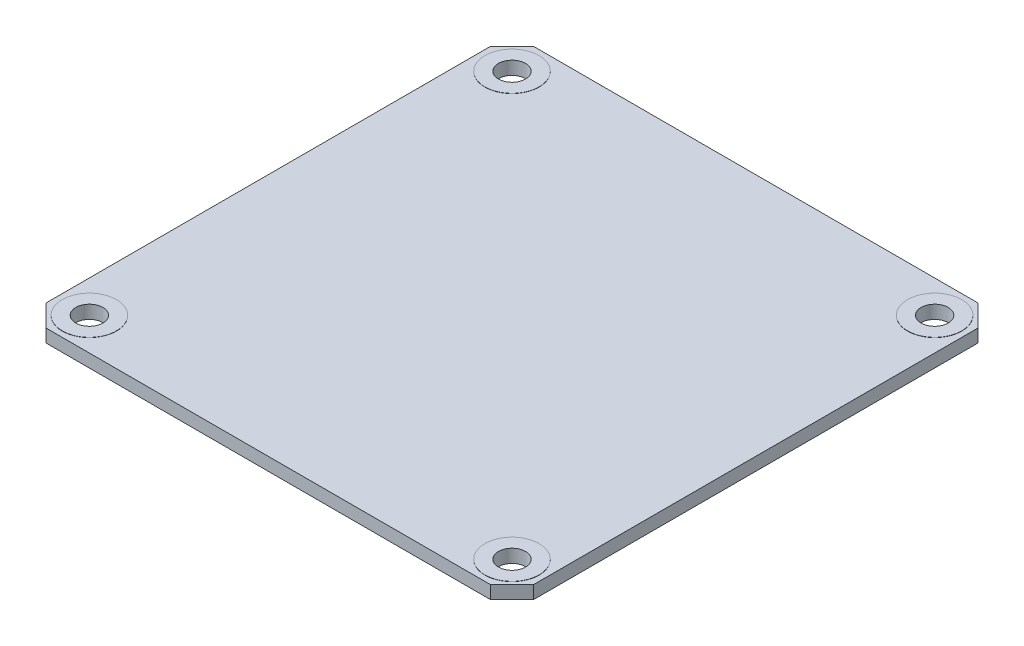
ISO-10303-21;
HEADER;
FILE_DESCRIPTION(('STEP AP214'),'2;1');
FILE_NAME('part.step','',(''),(''),'','','');
FILE_SCHEMA(('AUTOMOTIVE_DESIGN { 1 0 10303 214 1 1 1 1 }'));
ENDSEC;
DATA;
#1=APPLICATION_CONTEXT('core data for automotive mechanical design processes');
#2=APPLICATION_PROTOCOL_DEFINITION('international standard','automotive_design',2000,#1);
#3=PRODUCT_CONTEXT('',#1,'mechanical');
#4=PRODUCT('Part','Part','',(#3));
#5=PRODUCT_RELATED_PRODUCT_CATEGORY('part','',(#4));
#6=PRODUCT_DEFINITION_FORMATION('','',#4);
#7=PRODUCT_DEFINITION_CONTEXT('part definition',#1,'design');
#8=PRODUCT_DEFINITION('design','',#6,#7);
#9=PRODUCT_DEFINITION_SHAPE('','',#8);
#10=(LENGTH_UNIT() NAMED_UNIT(*) SI_UNIT(.MILLI.,.METRE.));
#11=(NAMED_UNIT(*) PLANE_ANGLE_UNIT() SI_UNIT($,.RADIAN.));
#12=(NAMED_UNIT(*) SI_UNIT($,.STERADIAN.) SOLID_ANGLE_UNIT());
#13=UNCERTAINTY_MEASURE_WITH_UNIT(LENGTH_MEASURE(1.E-05),#10,'distance_accuracy_value','');
#14=(GEOMETRIC_REPRESENTATION_CONTEXT(3) GLOBAL_UNCERTAINTY_ASSIGNED_CONTEXT((#13)) GLOBAL_UNIT_ASSIGNED_CONTEXT((#10,
#11,#12)) REPRESENTATION_CONTEXT('',''));
#15=CARTESIAN_POINT('',(0.,0.,0.));
#16=DIRECTION('',(0.,0.,1.));
#17=DIRECTION('',(1.,0.,0.));
#18=AXIS2_PLACEMENT_3D('',#15,#16,#17);
#19=CARTESIAN_POINT('',(3.81,1.524,-53.34));
#20=DIRECTION('',(0.,1.,0.));
#21=DIRECTION('',(0.,0.,1.));
#22=AXIS2_PLACEMENT_3D('',#19,#20,#21);
#23=CYLINDRICAL_SURFACE('',#22,3.175);
#24=CARTESIAN_POINT('',(3.81,1.5494,-53.34));
#25=DIRECTION('',(0.,1.,0.));
#26=DIRECTION('',(0.,0.,1.));
#27=AXIS2_PLACEMENT_3D('',#24,#25,#26);
#28=CIRCLE('',#27,3.175);
#29=CARTESIAN_POINT('',(3.81,1.5494,-50.165));
#30=VERTEX_POINT('',#29);
#31=EDGE_CURVE('E152',#30,#30,#28,.T.);
#32=ORIENTED_EDGE('',*,*,#31,.F.);
#33=EDGE_LOOP('',(#32));
#34=FACE_BOUND('',#33,.T.);
#35=CARTESIAN_POINT('',(3.81,1.524,-53.34));
#36=DIRECTION('',(0.,1.,0.));
#37=DIRECTION('',(0.,0.,1.));
#38=AXIS2_PLACEMENT_3D('',#35,#36,#37);
#39=CIRCLE('',#38,3.175);
#40=CARTESIAN_POINT('',(3.81,1.524,-50.165));
#41=VERTEX_POINT('',#40);
#42=EDGE_CURVE('E20',#41,#41,#39,.F.);
#43=ORIENTED_EDGE('',*,*,#42,.F.);
#44=EDGE_LOOP('',(#43));
#45=FACE_BOUND('',#44,.T.);
#46=ADVANCED_FACE('F16',(#34,#45),#23,.T.);
#47=CARTESIAN_POINT('',(53.34,1.524,-3.81));
#48=DIRECTION('',(0.,1.,0.));
#49=DIRECTION('',(0.,0.,1.));
#50=AXIS2_PLACEMENT_3D('',#47,#48,#49);
#51=CYLINDRICAL_SURFACE('',#50,3.175);
#52=CARTESIAN_POINT('',(53.34,1.5494,-3.81));
#53=DIRECTION('',(0.,1.,0.));
#54=DIRECTION('',(0.,0.,1.));
#55=AXIS2_PLACEMENT_3D('',#52,#53,#54);
#56=CIRCLE('',#55,3.175);
#57=CARTESIAN_POINT('',(53.34,1.5494,-0.635));
#58=VERTEX_POINT('',#57);
#59=EDGE_CURVE('E149',#58,#58,#56,.T.);
#60=ORIENTED_EDGE('',*,*,#59,.F.);
#61=EDGE_LOOP('',(#60));
#62=FACE_BOUND('',#61,.T.);
#63=CARTESIAN_POINT('',(53.34,1.524,-3.81));
#64=DIRECTION('',(0.,1.,0.));
#65=DIRECTION('',(0.,0.,1.));
#66=AXIS2_PLACEMENT_3D('',#63,#64,#65);
#67=CIRCLE('',#66,3.175);
#68=CARTESIAN_POINT('',(53.34,1.524,-0.635));
#69=VERTEX_POINT('',#68);
#70=EDGE_CURVE('E160',#69,#69,#67,.F.);
#71=ORIENTED_EDGE('',*,*,#70,.F.);
#72=EDGE_LOOP('',(#71));
#73=FACE_BOUND('',#72,.T.);
#74=ADVANCED_FACE('F169',(#62,#73),#51,.T.);
#75=CARTESIAN_POINT('',(53.34,1.524,-53.34));
#76=DIRECTION('',(0.,1.,0.));
#77=DIRECTION('',(0.,0.,1.));
#78=AXIS2_PLACEMENT_3D('',#75,#76,#77);
#79=CYLINDRICAL_SURFACE('',#78,3.175);
#80=CARTESIAN_POINT('',(53.34,1.5494,-53.34));
#81=DIRECTION('',(0.,1.,0.));
#82=DIRECTION('',(0.,0.,1.));
#83=AXIS2_PLACEMENT_3D('',#80,#81,#82);
#84=CIRCLE('',#83,3.175);
#85=CARTESIAN_POINT('',(53.34,1.5494,-50.165));
#86=VERTEX_POINT('',#85);
#87=EDGE_CURVE('E146',#86,#86,#84,.T.);
#88=ORIENTED_EDGE('',*,*,#87,.F.);
#89=EDGE_LOOP('',(#88));
#90=FACE_BOUND('',#89,.T.);
#91=CARTESIAN_POINT('',(53.34,1.524,-53.34));
#92=DIRECTION('',(0.,1.,0.));
#93=DIRECTION('',(0.,0.,1.));
#94=AXIS2_PLACEMENT_3D('',#91,#92,#93);
#95=CIRCLE('',#94,3.175);
#96=CARTESIAN_POINT('',(53.34,1.524,-50.165));
#97=VERTEX_POINT('',#96);
#98=EDGE_CURVE('E158',#97,#97,#95,.F.);
#99=ORIENTED_EDGE('',*,*,#98,.F.);
#100=EDGE_LOOP('',(#99));
#101=FACE_BOUND('',#100,.T.);
#102=ADVANCED_FACE('F176',(#90,#101),#79,.T.);
#103=CARTESIAN_POINT('',(3.81,1.524,-3.81));
#104=DIRECTION('',(0.,1.,0.));
#105=DIRECTION('',(0.,0.,1.));
#106=AXIS2_PLACEMENT_3D('',#103,#104,#105);
#107=CYLINDRICAL_SURFACE('',#106,3.175);
#108=CARTESIAN_POINT('',(3.81,1.5494,-3.81));
#109=DIRECTION('',(0.,1.,0.));
#110=DIRECTION('',(0.,0.,1.));
#111=AXIS2_PLACEMENT_3D('',#108,#109,#110);
#112=CIRCLE('',#111,3.175);
#113=CARTESIAN_POINT('',(3.81,1.5494,-0.635));
#114=VERTEX_POINT('',#113);
#115=EDGE_CURVE('E96',#114,#114,#112,.T.);
#116=ORIENTED_EDGE('',*,*,#115,.F.);
#117=EDGE_LOOP('',(#116));
#118=FACE_BOUND('',#117,.T.);
#119=CARTESIAN_POINT('',(3.81,1.524,-3.81));
#120=DIRECTION('',(0.,1.,0.));
#121=DIRECTION('',(0.,0.,1.));
#122=AXIS2_PLACEMENT_3D('',#119,#120,#121);
#123=CIRCLE('',#122,3.175);
#124=CARTESIAN_POINT('',(3.81,1.524,-0.635));
#125=VERTEX_POINT('',#124);
#126=EDGE_CURVE('E155',#125,#125,#123,.F.);
#127=ORIENTED_EDGE('',*,*,#126,.F.);
#128=EDGE_LOOP('',(#127));
#129=FACE_BOUND('',#128,.T.);
#130=ADVANCED_FACE('F272',(#118,#129),#107,.T.);
#131=CARTESIAN_POINT('',(-1.143,1.524,1.143));
#132=DIRECTION('',(0.,1.,0.));
#133=DIRECTION('',(1.,0.,0.));
#134=AXIS2_PLACEMENT_3D('',#131,#132,#133);
#135=PLANE('',#134);
#136=ORIENTED_EDGE('',*,*,#126,.T.);
#137=EDGE_LOOP('',(#136));
#138=FACE_BOUND('',#137,.T.);
#139=ORIENTED_EDGE('',*,*,#98,.T.);
#140=EDGE_LOOP('',(#139));
#141=FACE_BOUND('',#140,.T.);
#142=ORIENTED_EDGE('',*,*,#70,.T.);
#143=EDGE_LOOP('',(#142));
#144=FACE_BOUND('',#143,.T.);
#145=ORIENTED_EDGE('',*,*,#42,.T.);
#146=EDGE_LOOP('',(#145));
#147=FACE_BOUND('',#146,.T.);
#148=DIRECTION('',(-0.707106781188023,0.,0.707106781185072));
#149=VECTOR('',#148,1.);
#150=CARTESIAN_POINT('',(55.88,1.52399999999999,-1.27000000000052));
#151=LINE('',#150,#149);
#152=CARTESIAN_POINT('',(57.1500000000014,1.524,-2.54000000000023));
#153=VERTEX_POINT('',#152);
#154=CARTESIAN_POINT('',(54.6099999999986,1.524,0.));
#155=VERTEX_POINT('',#154);
#156=EDGE_CURVE('E451',#153,#155,#151,.T.);
#157=ORIENTED_EDGE('',*,*,#156,.F.);
#158=DIRECTION('',(0.,0.,1.));
#159=VECTOR('',#158,1.);
#160=CARTESIAN_POINT('',(57.15,1.524,-28.575));
#161=LINE('',#160,#159);
#162=CARTESIAN_POINT('',(57.1500000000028,1.524,-54.6099999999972));
#163=VERTEX_POINT('',#162);
#164=EDGE_CURVE('E65',#163,#153,#161,.T.);
#165=ORIENTED_EDGE('',*,*,#164,.F.);
#166=DIRECTION('',(0.707106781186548,0.,0.707106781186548));
#167=VECTOR('',#166,1.);
#168=CARTESIAN_POINT('',(55.88,1.52399999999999,-55.88));
#169=LINE('',#168,#167);
#170=CARTESIAN_POINT('',(54.6099999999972,1.524,-57.1500000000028));
#171=VERTEX_POINT('',#170);
#172=EDGE_CURVE('E88',#171,#163,#169,.T.);
#173=ORIENTED_EDGE('',*,*,#172,.F.);
#174=DIRECTION('',(1.,0.,0.));
#175=VECTOR('',#174,1.);
#176=CARTESIAN_POINT('',(28.575,1.524,-57.15));
#177=LINE('',#176,#175);
#178=CARTESIAN_POINT('',(2.54000000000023,1.524,-57.1500000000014));
#179=VERTEX_POINT('',#178);
#180=EDGE_CURVE('E91',#179,#171,#177,.T.);
#181=ORIENTED_EDGE('',*,*,#180,.F.);
#182=DIRECTION('',(0.707106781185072,0.,-0.707106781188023));
#183=VECTOR('',#182,1.);
#184=CARTESIAN_POINT('',(1.27000000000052,1.52399999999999,-55.88));
#185=LINE('',#184,#183);
#186=CARTESIAN_POINT('',(0.,1.524,-54.6099999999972));
#187=VERTEX_POINT('',#186);
#188=EDGE_CURVE('E102',#187,#179,#185,.T.);
#189=ORIENTED_EDGE('',*,*,#188,.F.);
#190=DIRECTION('',(0.,0.,-1.));
#191=VECTOR('',#190,1.);
#192=CARTESIAN_POINT('',(0.,1.524,-28.575));
#193=LINE('',#192,#191);
#194=CARTESIAN_POINT('',(0.,1.524,-2.54000000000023));
#195=VERTEX_POINT('',#194);
#196=EDGE_CURVE('E224',#195,#187,#193,.T.);
#197=ORIENTED_EDGE('',*,*,#196,.F.);
#198=DIRECTION('',(-0.707106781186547,0.,-0.707106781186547));
#199=VECTOR('',#198,1.);
#200=CARTESIAN_POINT('',(1.27000000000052,1.52399999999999,-1.27000000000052));
#201=LINE('',#200,#199);
#202=CARTESIAN_POINT('',(2.54000000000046,1.524,0.));
#203=VERTEX_POINT('',#202);
#204=EDGE_CURVE('E217',#203,#195,#201,.T.);
#205=ORIENTED_EDGE('',*,*,#204,.F.);
#206=DIRECTION('',(-1.,0.,0.));
#207=VECTOR('',#206,1.);
#208=CARTESIAN_POINT('',(28.575,1.524,0.));
#209=LINE('',#208,#207);
#210=EDGE_CURVE('E221',#155,#203,#209,.T.);
#211=ORIENTED_EDGE('',*,*,#210,.F.);
#212=EDGE_LOOP('',(#157,#165,#173,#181,#189,#197,#205,#211));
#213=FACE_BOUND('',#212,.T.);
#214=ADVANCED_FACE('F90',(#138,#141,#144,#147,#213),#135,.T.);
#215=CARTESIAN_POINT('',(-0.4826,1.5494,0.489481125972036));
#216=DIRECTION('',(0.,1.,0.));
#217=DIRECTION('',(1.,0.,0.));
#218=AXIS2_PLACEMENT_3D('',#215,#216,#217);
#219=PLANE('',#218);
#220=CARTESIAN_POINT('',(3.81,1.54939999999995,-53.34));
#221=DIRECTION('',(0.,1.,0.));
#222=DIRECTION('',(0.,0.,1.));
#223=AXIS2_PLACEMENT_3D('',#220,#221,#222);
#224=CIRCLE('',#223,1.5875);
#225=CARTESIAN_POINT('',(3.81,1.54939999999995,-51.7525));
#226=VERTEX_POINT('',#225);
#227=EDGE_CURVE('E141',#226,#226,#224,.T.);
#228=ORIENTED_EDGE('',*,*,#227,.F.);
#229=EDGE_LOOP('',(#228));
#230=FACE_BOUND('',#229,.T.);
#231=ORIENTED_EDGE('',*,*,#31,.T.);
#232=EDGE_LOOP('',(#231));
#233=FACE_BOUND('',#232,.T.);
#234=ADVANCED_FACE('F284',(#230,#233),#219,.T.);
#235=CARTESIAN_POINT('',(-0.4826,1.5494,0.489481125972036));
#236=DIRECTION('',(0.,1.,0.));
#237=DIRECTION('',(1.,0.,0.));
#238=AXIS2_PLACEMENT_3D('',#235,#236,#237);
#239=PLANE('',#238);
#240=CARTESIAN_POINT('',(53.34,1.54939999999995,-3.81));
#241=DIRECTION('',(0.,1.,0.));
#242=DIRECTION('',(0.,0.,1.));
#243=AXIS2_PLACEMENT_3D('',#240,#241,#242);
#244=CIRCLE('',#243,1.5875);
#245=CARTESIAN_POINT('',(53.34,1.54939999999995,-2.2225));
#246=VERTEX_POINT('',#245);
#247=EDGE_CURVE('E138',#246,#246,#244,.T.);
#248=ORIENTED_EDGE('',*,*,#247,.F.);
#249=EDGE_LOOP('',(#248));
#250=FACE_BOUND('',#249,.T.);
#251=ORIENTED_EDGE('',*,*,#59,.T.);
#252=EDGE_LOOP('',(#251));
#253=FACE_BOUND('',#252,.T.);
#254=ADVANCED_FACE('F289',(#250,#253),#239,.T.);
#255=CARTESIAN_POINT('',(-0.4826,1.5494,0.489481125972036));
#256=DIRECTION('',(0.,1.,0.));
#257=DIRECTION('',(1.,0.,0.));
#258=AXIS2_PLACEMENT_3D('',#255,#256,#257);
#259=PLANE('',#258);
#260=CARTESIAN_POINT('',(53.34,1.54939999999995,-53.34));
#261=DIRECTION('',(0.,1.,0.));
#262=DIRECTION('',(0.,0.,1.));
#263=AXIS2_PLACEMENT_3D('',#260,#261,#262);
#264=CIRCLE('',#263,1.5875);
#265=CARTESIAN_POINT('',(53.34,1.54939999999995,-51.7525));
#266=VERTEX_POINT('',#265);
#267=EDGE_CURVE('E135',#266,#266,#264,.T.);
#268=ORIENTED_EDGE('',*,*,#267,.F.);
#269=EDGE_LOOP('',(#268));
#270=FACE_BOUND('',#269,.T.);
#271=ORIENTED_EDGE('',*,*,#87,.T.);
#272=EDGE_LOOP('',(#271));
#273=FACE_BOUND('',#272,.T.);
#274=ADVANCED_FACE('F295',(#270,#273),#259,.T.);
#275=CARTESIAN_POINT('',(-0.4826,1.5494,0.489481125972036));
#276=DIRECTION('',(0.,1.,0.));
#277=DIRECTION('',(1.,0.,0.));
#278=AXIS2_PLACEMENT_3D('',#275,#276,#277);
#279=PLANE('',#278);
#280=CARTESIAN_POINT('',(3.81,1.54939999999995,-3.81));
#281=DIRECTION('',(0.,1.,0.));
#282=DIRECTION('',(0.,0.,1.));
#283=AXIS2_PLACEMENT_3D('',#280,#281,#282);
#284=CIRCLE('',#283,1.5875);
#285=CARTESIAN_POINT('',(3.81,1.54939999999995,-2.2225));
#286=VERTEX_POINT('',#285);
#287=EDGE_CURVE('E132',#286,#286,#284,.T.);
#288=ORIENTED_EDGE('',*,*,#287,.F.);
#289=EDGE_LOOP('',(#288));
#290=FACE_BOUND('',#289,.T.);
#291=ORIENTED_EDGE('',*,*,#115,.T.);
#292=EDGE_LOOP('',(#291));
#293=FACE_BOUND('',#292,.T.);
#294=ADVANCED_FACE('F299',(#290,#293),#279,.T.);
#295=CARTESIAN_POINT('',(54.5414073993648,1.62100458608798,-57.2185926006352));
#296=DIRECTION('',(0.707106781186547,0.,-0.707106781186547));
#297=DIRECTION('',(0.707106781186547,0.,0.707106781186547));
#298=AXIS2_PLACEMENT_3D('',#295,#296,#297);
#299=PLANE('',#298);
#300=ORIENTED_EDGE('',*,*,#172,.T.);
#301=DIRECTION('',(0.,1.,0.));
#302=VECTOR('',#301,1.);
#303=CARTESIAN_POINT('',(57.15,0.761999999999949,-54.61));
#304=LINE('',#303,#302);
#305=CARTESIAN_POINT('',(57.15,0.,-54.61));
#306=VERTEX_POINT('',#305);
#307=EDGE_CURVE('E107',#306,#163,#304,.T.);
#308=ORIENTED_EDGE('',*,*,#307,.F.);
#309=DIRECTION('',(0.707106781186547,0.,0.707106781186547));
#310=VECTOR('',#309,1.);
#311=CARTESIAN_POINT('',(54.5414073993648,0.,-57.2185926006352));
#312=LINE('',#311,#310);
#313=CARTESIAN_POINT('',(54.61,0.,-57.15));
#314=VERTEX_POINT('',#313);
#315=EDGE_CURVE('E58',#306,#314,#312,.F.);
#316=ORIENTED_EDGE('',*,*,#315,.T.);
#317=DIRECTION('',(0.,-1.,0.));
#318=VECTOR('',#317,1.);
#319=CARTESIAN_POINT('',(54.61,0.761999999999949,-57.15));
#320=LINE('',#319,#318);
#321=EDGE_CURVE('E95',#171,#314,#320,.T.);
#322=ORIENTED_EDGE('',*,*,#321,.F.);
#323=EDGE_LOOP('',(#300,#308,#316,#322));
#324=FACE_BOUND('',#323,.T.);
#325=ADVANCED_FACE('F104',(#324),#299,.T.);
#326=CARTESIAN_POINT('',(55.6514,-0.0970045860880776,-57.15));
#327=DIRECTION('',(0.,0.,-1.));
#328=DIRECTION('',(-1.,0.,0.));
#329=AXIS2_PLACEMENT_3D('',#326,#327,#328);
#330=PLANE('',#329);
#331=DIRECTION('',(0.,-1.,0.));
#332=VECTOR('',#331,1.);
#333=CARTESIAN_POINT('',(2.54000000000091,0.761999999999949,-57.1500000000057));
#334=LINE('',#333,#332);
#335=CARTESIAN_POINT('',(2.53999999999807,0.,-57.1500000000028));
#336=VERTEX_POINT('',#335);
#337=EDGE_CURVE('E101',#179,#336,#334,.T.);
#338=ORIENTED_EDGE('',*,*,#337,.F.);
#339=ORIENTED_EDGE('',*,*,#180,.T.);
#340=ORIENTED_EDGE('',*,*,#321,.T.);
#341=DIRECTION('',(-1.,0.,0.));
#342=VECTOR('',#341,1.);
#343=CARTESIAN_POINT('',(28.575,0.,-57.15));
#344=LINE('',#343,#342);
#345=EDGE_CURVE('E130',#314,#336,#344,.T.);
#346=ORIENTED_EDGE('',*,*,#345,.T.);
#347=EDGE_LOOP('',(#338,#339,#340,#346));
#348=FACE_BOUND('',#347,.T.);
#349=ADVANCED_FACE('F99',(#348),#330,.T.);
#350=CARTESIAN_POINT('',(-0.0685926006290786,1.62100458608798,-54.5414073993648));
#351=DIRECTION('',(-0.707106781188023,0.,-0.707106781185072));
#352=DIRECTION('',(0.707106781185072,0.,-0.707106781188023));
#353=AXIS2_PLACEMENT_3D('',#350,#351,#352);
#354=PLANE('',#353);
#355=ORIENTED_EDGE('',*,*,#188,.T.);
#356=ORIENTED_EDGE('',*,*,#337,.T.);
#357=DIRECTION('',(0.707106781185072,0.,-0.707106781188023));
#358=VECTOR('',#357,1.);
#359=CARTESIAN_POINT('',(-0.0685926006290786,0.,-54.5414073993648));
#360=LINE('',#359,#358);
#361=CARTESIAN_POINT('',(0.,0.,-54.6099999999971));
#362=VERTEX_POINT('',#361);
#363=EDGE_CURVE('E127',#336,#362,#360,.F.);
#364=ORIENTED_EDGE('',*,*,#363,.T.);
#365=DIRECTION('',(0.,-1.,0.));
#366=VECTOR('',#365,1.);
#367=CARTESIAN_POINT('',(0.,0.761999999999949,-54.61));
#368=LINE('',#367,#366);
#369=EDGE_CURVE('E223',#187,#362,#368,.T.);
#370=ORIENTED_EDGE('',*,*,#369,.F.);
#371=EDGE_LOOP('',(#355,#356,#364,#370));
#372=FACE_BOUND('',#371,.T.);
#373=ADVANCED_FACE('F236',(#372),#354,.T.);
#374=CARTESIAN_POINT('',(0.,-0.0970045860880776,-55.6514));
#375=DIRECTION('',(-1.,0.,0.));
#376=DIRECTION('',(0.,0.,1.));
#377=AXIS2_PLACEMENT_3D('',#374,#375,#376);
#378=PLANE('',#377);
#379=DIRECTION('',(0.,-1.,0.));
#380=VECTOR('',#379,1.);
#381=CARTESIAN_POINT('',(1.28843875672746E-13,0.761999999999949,-2.54000000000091));
#382=LINE('',#381,#380);
#383=CARTESIAN_POINT('',(0.,0.,-2.54000000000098));
#384=VERTEX_POINT('',#383);
#385=EDGE_CURVE('E215',#195,#384,#382,.T.);
#386=ORIENTED_EDGE('',*,*,#385,.F.);
#387=ORIENTED_EDGE('',*,*,#196,.T.);
#388=ORIENTED_EDGE('',*,*,#369,.T.);
#389=DIRECTION('',(0.,0.,1.));
#390=VECTOR('',#389,1.);
#391=CARTESIAN_POINT('',(0.,0.,-28.575));
#392=LINE('',#391,#390);
#393=EDGE_CURVE('E126',#362,#384,#392,.T.);
#394=ORIENTED_EDGE('',*,*,#393,.T.);
#395=EDGE_LOOP('',(#386,#387,#388,#394));
#396=FACE_BOUND('',#395,.T.);
#397=ADVANCED_FACE('F239',(#396),#378,.T.);
#398=CARTESIAN_POINT('',(2.60859260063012,1.62100458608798,0.0685926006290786));
#399=DIRECTION('',(-0.707106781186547,0.,0.707106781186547));
#400=DIRECTION('',(-0.707106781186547,0.,-0.707106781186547));
#401=AXIS2_PLACEMENT_3D('',#398,#399,#400);
#402=PLANE('',#401);
#403=ORIENTED_EDGE('',*,*,#204,.T.);
#404=ORIENTED_EDGE('',*,*,#385,.T.);
#405=DIRECTION('',(-0.707106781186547,0.,-0.707106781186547));
#406=VECTOR('',#405,1.);
#407=CARTESIAN_POINT('',(2.60859260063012,0.,0.0685926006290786));
#408=LINE('',#407,#406);
#409=CARTESIAN_POINT('',(2.54000000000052,0.,0.));
#410=VERTEX_POINT('',#409);
#411=EDGE_CURVE('E123',#384,#410,#408,.F.);
#412=ORIENTED_EDGE('',*,*,#411,.T.);
#413=DIRECTION('',(0.,-1.,0.));
#414=VECTOR('',#413,1.);
#415=CARTESIAN_POINT('',(2.54,0.761999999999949,0.));
#416=LINE('',#415,#414);
#417=EDGE_CURVE('E209',#203,#410,#416,.T.);
#418=ORIENTED_EDGE('',*,*,#417,.F.);
#419=EDGE_LOOP('',(#403,#404,#412,#418));
#420=FACE_BOUND('',#419,.T.);
#421=ADVANCED_FACE('F241',(#420),#402,.T.);
#422=CARTESIAN_POINT('',(1.4986,-0.0970045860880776,0.));
#423=DIRECTION('',(0.,0.,1.));
#424=DIRECTION('',(1.,0.,0.));
#425=AXIS2_PLACEMENT_3D('',#422,#423,#424);
#426=PLANE('',#425);
#427=DIRECTION('',(0.,-1.,0.));
#428=VECTOR('',#427,1.);
#429=CARTESIAN_POINT('',(54.6099999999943,0.761999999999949,-1.28843875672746E-13));
#430=LINE('',#429,#428);
#431=CARTESIAN_POINT('',(54.6099999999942,0.,0.));
#432=VERTEX_POINT('',#431);
#433=EDGE_CURVE('E207',#155,#432,#430,.T.);
#434=ORIENTED_EDGE('',*,*,#433,.F.);
#435=ORIENTED_EDGE('',*,*,#210,.T.);
#436=ORIENTED_EDGE('',*,*,#417,.T.);
#437=DIRECTION('',(1.,0.,0.));
#438=VECTOR('',#437,1.);
#439=CARTESIAN_POINT('',(28.575,0.,0.));
#440=LINE('',#439,#438);
#441=EDGE_CURVE('E122',#410,#432,#440,.T.);
#442=ORIENTED_EDGE('',*,*,#441,.T.);
#443=EDGE_LOOP('',(#434,#435,#436,#442));
#444=FACE_BOUND('',#443,.T.);
#445=ADVANCED_FACE('F205',(#444),#426,.T.);
#446=CARTESIAN_POINT('',(57.2185926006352,1.62100458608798,-2.60859260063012));
#447=DIRECTION('',(0.707106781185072,0.,0.707106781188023));
#448=DIRECTION('',(-0.707106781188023,0.,0.707106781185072));
#449=AXIS2_PLACEMENT_3D('',#446,#447,#448);
#450=PLANE('',#449);
#451=ORIENTED_EDGE('',*,*,#156,.T.);
#452=ORIENTED_EDGE('',*,*,#433,.T.);
#453=DIRECTION('',(-0.707106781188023,0.,0.707106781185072));
#454=VECTOR('',#453,1.);
#455=CARTESIAN_POINT('',(57.2185926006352,0.,-2.60859260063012));
#456=LINE('',#455,#454);
#457=CARTESIAN_POINT('',(57.15,0.,-2.53999999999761));
#458=VERTEX_POINT('',#457);
#459=EDGE_CURVE('E119',#432,#458,#456,.F.);
#460=ORIENTED_EDGE('',*,*,#459,.T.);
#461=DIRECTION('',(0.,-1.,0.));
#462=VECTOR('',#461,1.);
#463=CARTESIAN_POINT('',(57.15,0.761999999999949,-2.54));
#464=LINE('',#463,#462);
#465=EDGE_CURVE('E35',#153,#458,#464,.T.);
#466=ORIENTED_EDGE('',*,*,#465,.F.);
#467=EDGE_LOOP('',(#451,#452,#460,#466));
#468=FACE_BOUND('',#467,.T.);
#469=ADVANCED_FACE('F248',(#468),#450,.T.);
#470=CARTESIAN_POINT('',(57.15,-0.0970045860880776,-1.4986));
#471=DIRECTION('',(1.,0.,0.));
#472=DIRECTION('',(0.,0.,-1.));
#473=AXIS2_PLACEMENT_3D('',#470,#471,#472);
#474=PLANE('',#473);
#475=ORIENTED_EDGE('',*,*,#465,.T.);
#476=DIRECTION('',(0.,0.,-1.));
#477=VECTOR('',#476,1.);
#478=CARTESIAN_POINT('',(57.15,0.,-28.575));
#479=LINE('',#478,#477);
#480=EDGE_CURVE('E118',#458,#306,#479,.T.);
#481=ORIENTED_EDGE('',*,*,#480,.T.);
#482=ORIENTED_EDGE('',*,*,#307,.T.);
#483=ORIENTED_EDGE('',*,*,#164,.T.);
#484=EDGE_LOOP('',(#475,#481,#482,#483));
#485=FACE_BOUND('',#484,.T.);
#486=ADVANCED_FACE('F254',(#485),#474,.T.);
#487=CARTESIAN_POINT('',(3.81,0.,-53.34));
#488=DIRECTION('',(0.,1.,0.));
#489=DIRECTION('',(0.,0.,1.));
#490=AXIS2_PLACEMENT_3D('',#487,#488,#489);
#491=CYLINDRICAL_SURFACE('',#490,1.5875);
#492=CARTESIAN_POINT('',(3.81,0.,-53.34));
#493=DIRECTION('',(0.,1.,0.));
#494=DIRECTION('',(0.,0.,1.));
#495=AXIS2_PLACEMENT_3D('',#492,#493,#494);
#496=CIRCLE('',#495,1.5875);
#497=CARTESIAN_POINT('',(3.81,0.,-51.7525));
#498=VERTEX_POINT('',#497);
#499=EDGE_CURVE('E115',#498,#498,#496,.F.);
#500=ORIENTED_EDGE('',*,*,#499,.T.);
#501=EDGE_LOOP('',(#500));
#502=FACE_BOUND('',#501,.T.);
#503=ORIENTED_EDGE('',*,*,#227,.T.);
#504=EDGE_LOOP('',(#503));
#505=FACE_BOUND('',#504,.T.);
#506=ADVANCED_FACE('F256',(#502,#505),#491,.F.);
#507=CARTESIAN_POINT('',(53.34,0.,-3.81));
#508=DIRECTION('',(0.,1.,0.));
#509=DIRECTION('',(0.,0.,1.));
#510=AXIS2_PLACEMENT_3D('',#507,#508,#509);
#511=CYLINDRICAL_SURFACE('',#510,1.5875);
#512=CARTESIAN_POINT('',(53.34,0.,-3.81));
#513=DIRECTION('',(0.,1.,0.));
#514=DIRECTION('',(0.,0.,1.));
#515=AXIS2_PLACEMENT_3D('',#512,#513,#514);
#516=CIRCLE('',#515,1.5875);
#517=CARTESIAN_POINT('',(53.34,0.,-2.2225));
#518=VERTEX_POINT('',#517);
#519=EDGE_CURVE('E112',#518,#518,#516,.F.);
#520=ORIENTED_EDGE('',*,*,#519,.T.);
#521=EDGE_LOOP('',(#520));
#522=FACE_BOUND('',#521,.T.);
#523=ORIENTED_EDGE('',*,*,#247,.T.);
#524=EDGE_LOOP('',(#523));
#525=FACE_BOUND('',#524,.T.);
#526=ADVANCED_FACE('F260',(#522,#525),#511,.F.);
#527=CARTESIAN_POINT('',(53.34,0.,-53.34));
#528=DIRECTION('',(0.,1.,0.));
#529=DIRECTION('',(0.,0.,1.));
#530=AXIS2_PLACEMENT_3D('',#527,#528,#529);
#531=CYLINDRICAL_SURFACE('',#530,1.5875);
#532=CARTESIAN_POINT('',(53.34,0.,-53.34));
#533=DIRECTION('',(0.,1.,0.));
#534=DIRECTION('',(0.,0.,1.));
#535=AXIS2_PLACEMENT_3D('',#532,#533,#534);
#536=CIRCLE('',#535,1.5875);
#537=CARTESIAN_POINT('',(53.34,0.,-51.7525));
#538=VERTEX_POINT('',#537);
#539=EDGE_CURVE('E26',#538,#538,#536,.F.);
#540=ORIENTED_EDGE('',*,*,#539,.T.);
#541=EDGE_LOOP('',(#540));
#542=FACE_BOUND('',#541,.T.);
#543=ORIENTED_EDGE('',*,*,#267,.T.);
#544=EDGE_LOOP('',(#543));
#545=FACE_BOUND('',#544,.T.);
#546=ADVANCED_FACE('F188',(#542,#545),#531,.F.);
#547=CARTESIAN_POINT('',(3.81,0.,-3.81));
#548=DIRECTION('',(0.,1.,0.));
#549=DIRECTION('',(0.,0.,1.));
#550=AXIS2_PLACEMENT_3D('',#547,#548,#549);
#551=CYLINDRICAL_SURFACE('',#550,1.5875);
#552=CARTESIAN_POINT('',(3.81,0.,-3.81));
#553=DIRECTION('',(0.,1.,0.));
#554=DIRECTION('',(0.,0.,1.));
#555=AXIS2_PLACEMENT_3D('',#552,#553,#554);
#556=CIRCLE('',#555,1.5875);
#557=CARTESIAN_POINT('',(3.81,0.,-2.2225));
#558=VERTEX_POINT('',#557);
#559=EDGE_CURVE('E11',#558,#558,#556,.F.);
#560=ORIENTED_EDGE('',*,*,#559,.T.);
#561=EDGE_LOOP('',(#560));
#562=FACE_BOUND('',#561,.T.);
#563=ORIENTED_EDGE('',*,*,#287,.T.);
#564=EDGE_LOOP('',(#563));
#565=FACE_BOUND('',#564,.T.);
#566=ADVANCED_FACE('F182',(#562,#565),#551,.F.);
#567=CARTESIAN_POINT('',(-1.143,0.,1.143));
#568=DIRECTION('',(0.,1.,0.));
#569=DIRECTION('',(1.,0.,0.));
#570=AXIS2_PLACEMENT_3D('',#567,#568,#569);
#571=PLANE('',#570);
#572=ORIENTED_EDGE('',*,*,#559,.F.);
#573=EDGE_LOOP('',(#572));
#574=FACE_BOUND('',#573,.T.);
#575=ORIENTED_EDGE('',*,*,#539,.F.);
#576=EDGE_LOOP('',(#575));
#577=FACE_BOUND('',#576,.T.);
#578=ORIENTED_EDGE('',*,*,#519,.F.);
#579=EDGE_LOOP('',(#578));
#580=FACE_BOUND('',#579,.T.);
#581=ORIENTED_EDGE('',*,*,#499,.F.);
#582=EDGE_LOOP('',(#581));
#583=FACE_BOUND('',#582,.T.);
#584=ORIENTED_EDGE('',*,*,#459,.F.);
#585=ORIENTED_EDGE('',*,*,#441,.F.);
#586=ORIENTED_EDGE('',*,*,#411,.F.);
#587=ORIENTED_EDGE('',*,*,#393,.F.);
#588=ORIENTED_EDGE('',*,*,#363,.F.);
#589=ORIENTED_EDGE('',*,*,#345,.F.);
#590=ORIENTED_EDGE('',*,*,#315,.F.);
#591=ORIENTED_EDGE('',*,*,#480,.F.);
#592=EDGE_LOOP('',(#584,#585,#586,#587,#588,#589,#590,#591));
#593=FACE_BOUND('',#592,.T.);
#594=ADVANCED_FACE('F18',(#574,#577,#580,#583,#593),#571,.F.);
#595=CLOSED_SHELL('',(#46,#74,#102,#130,#214,#234,#254,#274,#294,#325,#349,#373,#397,#421,#445,
#469,#486,#506,#526,#546,#566,#594));
#596=MANIFOLD_SOLID_BREP('B1',#595);
#597=ADVANCED_BREP_SHAPE_REPRESENTATION('',(#18,#596),#14);
#598=SHAPE_DEFINITION_REPRESENTATION(#9,#597);
ENDSEC;
END-ISO-10303-21;
